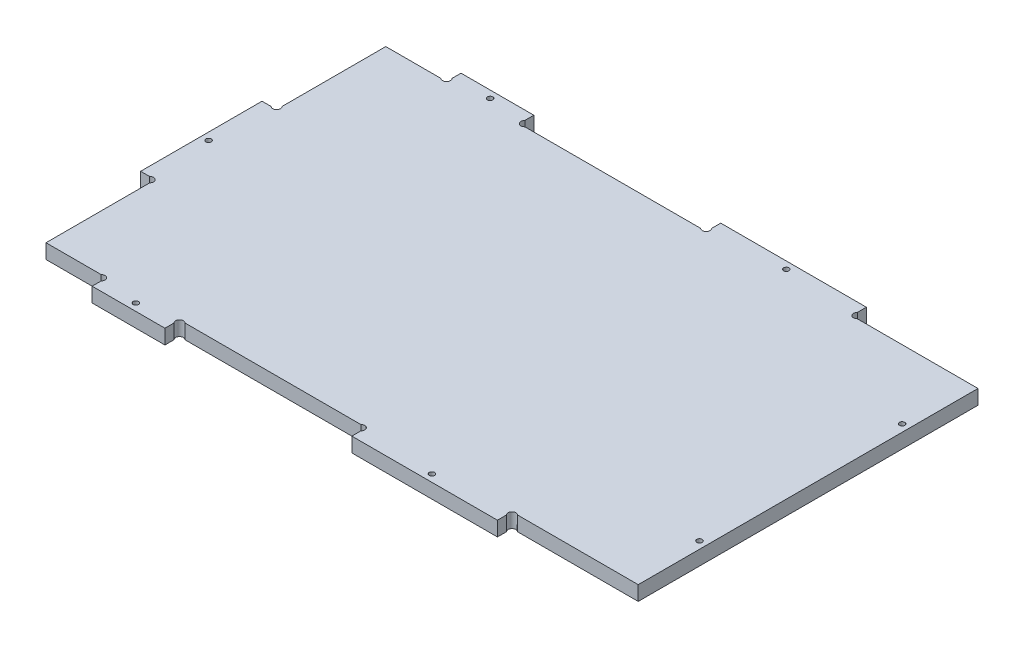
ISO-10303-21;
HEADER;
FILE_DESCRIPTION(('STEP AP214'),'2;1');
FILE_NAME('part.step','',(''),(''),'','','');
FILE_SCHEMA(('AUTOMOTIVE_DESIGN { 1 0 10303 214 1 1 1 1 }'));
ENDSEC;
DATA;
#1=APPLICATION_CONTEXT('core data for automotive mechanical design processes');
#2=APPLICATION_PROTOCOL_DEFINITION('international standard','automotive_design',2000,#1);
#3=PRODUCT_CONTEXT('',#1,'mechanical');
#4=PRODUCT('Part','Part','',(#3));
#5=PRODUCT_RELATED_PRODUCT_CATEGORY('part','',(#4));
#6=PRODUCT_DEFINITION_FORMATION('','',#4);
#7=PRODUCT_DEFINITION_CONTEXT('part definition',#1,'design');
#8=PRODUCT_DEFINITION('design','',#6,#7);
#9=PRODUCT_DEFINITION_SHAPE('','',#8);
#10=(LENGTH_UNIT() NAMED_UNIT(*) SI_UNIT(.MILLI.,.METRE.));
#11=(NAMED_UNIT(*) PLANE_ANGLE_UNIT() SI_UNIT($,.RADIAN.));
#12=(NAMED_UNIT(*) SI_UNIT($,.STERADIAN.) SOLID_ANGLE_UNIT());
#13=UNCERTAINTY_MEASURE_WITH_UNIT(LENGTH_MEASURE(1.E-05),#10,'distance_accuracy_value','');
#14=(GEOMETRIC_REPRESENTATION_CONTEXT(3) GLOBAL_UNCERTAINTY_ASSIGNED_CONTEXT((#13)) GLOBAL_UNIT_ASSIGNED_CONTEXT((#10,
#11,#12)) REPRESENTATION_CONTEXT('',''));
#15=CARTESIAN_POINT('',(0.,0.,0.));
#16=DIRECTION('',(0.,0.,1.));
#17=DIRECTION('',(1.,0.,0.));
#18=AXIS2_PLACEMENT_3D('',#15,#16,#17);
#19=CARTESIAN_POINT('',(29.8686291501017,6.,-147.131370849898));
#20=DIRECTION('',(0.,1.,0.));
#21=DIRECTION('',(0.,0.,1.));
#22=AXIS2_PLACEMENT_3D('',#19,#20,#21);
#23=PLANE('',#22);
#24=CARTESIAN_POINT('',(46.,6.,-3.00000000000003));
#25=DIRECTION('',(0.,1.,0.));
#26=DIRECTION('',(0.,0.,-1.));
#27=AXIS2_PLACEMENT_3D('',#24,#25,#26);
#28=CIRCLE('',#27,1.1);
#29=CARTESIAN_POINT('',(46.,6.,-4.10000000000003));
#30=VERTEX_POINT('',#29);
#31=EDGE_CURVE('E589',#30,#30,#28,.T.);
#32=ORIENTED_EDGE('',*,*,#31,.F.);
#33=EDGE_LOOP('',(#32));
#34=FACE_BOUND('',#33,.T.);
#35=CARTESIAN_POINT('',(168.,6.,-149.));
#36=DIRECTION('',(0.,1.,0.));
#37=DIRECTION('',(0.,0.,1.));
#38=AXIS2_PLACEMENT_3D('',#35,#36,#37);
#39=CIRCLE('',#38,1.09999999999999);
#40=CARTESIAN_POINT('',(168.,6.,-147.9));
#41=VERTEX_POINT('',#40);
#42=EDGE_CURVE('E601',#41,#41,#39,.T.);
#43=ORIENTED_EDGE('',*,*,#42,.F.);
#44=EDGE_LOOP('',(#43));
#45=FACE_BOUND('',#44,.T.);
#46=CARTESIAN_POINT('',(46.,6.,-149.));
#47=DIRECTION('',(0.,1.,0.));
#48=DIRECTION('',(0.,0.,1.));
#49=AXIS2_PLACEMENT_3D('',#46,#47,#48);
#50=CIRCLE('',#49,1.1);
#51=CARTESIAN_POINT('',(46.,6.,-147.9));
#52=VERTEX_POINT('',#51);
#53=EDGE_CURVE('E613',#52,#52,#50,.T.);
#54=ORIENTED_EDGE('',*,*,#53,.F.);
#55=EDGE_LOOP('',(#54));
#56=FACE_BOUND('',#55,.T.);
#57=CARTESIAN_POINT('',(29.8686291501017,6.,-147.131370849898));
#58=DIRECTION('',(0.,-1.,0.));
#59=DIRECTION('',(0.,0.,1.));
#60=AXIS2_PLACEMENT_3D('',#57,#58,#59);
#61=CIRCLE('',#60,1.59999999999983);
#62=CARTESIAN_POINT('',(31.,6.,-148.262741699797));
#63=VERTEX_POINT('',#62);
#64=CARTESIAN_POINT('',(28.7372583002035,6.,-146.));
#65=VERTEX_POINT('',#64);
#66=EDGE_CURVE('E353',#63,#65,#61,.T.);
#67=ORIENTED_EDGE('',*,*,#66,.T.);
#68=DIRECTION('',(-1.,0.,0.));
#69=VECTOR('',#68,1.);
#70=CARTESIAN_POINT('',(6.,6.,-146.));
#71=LINE('',#70,#69);
#72=CARTESIAN_POINT('',(6.,6.,-146.));
#73=VERTEX_POINT('',#72);
#74=EDGE_CURVE('E171',#65,#73,#71,.T.);
#75=ORIENTED_EDGE('',*,*,#74,.T.);
#76=DIRECTION('',(0.,0.,1.));
#77=VECTOR('',#76,1.);
#78=CARTESIAN_POINT('',(6.,6.,-103.262741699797));
#79=LINE('',#78,#77);
#80=CARTESIAN_POINT('',(6.,6.,-103.262741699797));
#81=VERTEX_POINT('',#80);
#82=EDGE_CURVE('E446',#73,#81,#79,.T.);
#83=ORIENTED_EDGE('',*,*,#82,.T.);
#84=CARTESIAN_POINT('',(4.86862915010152,6.,-102.131370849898));
#85=DIRECTION('',(0.,-1.,0.));
#86=DIRECTION('',(0.,0.,1.));
#87=AXIS2_PLACEMENT_3D('',#84,#85,#86);
#88=CIRCLE('',#87,1.6);
#89=CARTESIAN_POINT('',(3.73725830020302,6.,-101.));
#90=VERTEX_POINT('',#89);
#91=EDGE_CURVE('E465',#81,#90,#88,.T.);
#92=ORIENTED_EDGE('',*,*,#91,.T.);
#93=DIRECTION('',(-1.,0.,0.));
#94=VECTOR('',#93,1.);
#95=CARTESIAN_POINT('',(3.73725830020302,6.,-101.));
#96=LINE('',#95,#94);
#97=CARTESIAN_POINT('',(0.,6.,-101.));
#98=VERTEX_POINT('',#97);
#99=EDGE_CURVE('E462',#90,#98,#96,.T.);
#100=ORIENTED_EDGE('',*,*,#99,.T.);
#101=DIRECTION('',(0.,0.,1.));
#102=VECTOR('',#101,1.);
#103=CARTESIAN_POINT('',(0.,6.,-101.));
#104=LINE('',#103,#102);
#105=CARTESIAN_POINT('',(0.,6.,-51.));
#106=VERTEX_POINT('',#105);
#107=EDGE_CURVE('E464',#98,#106,#104,.T.);
#108=ORIENTED_EDGE('',*,*,#107,.T.);
#109=DIRECTION('',(1.,0.,0.));
#110=VECTOR('',#109,1.);
#111=CARTESIAN_POINT('',(3.73725830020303,6.,-51.));
#112=LINE('',#111,#110);
#113=CARTESIAN_POINT('',(3.73725830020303,6.,-51.));
#114=VERTEX_POINT('',#113);
#115=EDGE_CURVE('E467',#106,#114,#112,.T.);
#116=ORIENTED_EDGE('',*,*,#115,.T.);
#117=CARTESIAN_POINT('',(4.86862915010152,6.,-49.8686291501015));
#118=DIRECTION('',(0.,-1.,0.));
#119=DIRECTION('',(0.,0.,-1.));
#120=AXIS2_PLACEMENT_3D('',#117,#118,#119);
#121=CIRCLE('',#120,1.6);
#122=CARTESIAN_POINT('',(6.,6.,-48.7372583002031));
#123=VERTEX_POINT('',#122);
#124=EDGE_CURVE('E473',#114,#123,#121,.T.);
#125=ORIENTED_EDGE('',*,*,#124,.T.);
#126=DIRECTION('',(0.,0.,1.));
#127=VECTOR('',#126,1.);
#128=CARTESIAN_POINT('',(6.,6.,-48.7372583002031));
#129=LINE('',#128,#127);
#130=CARTESIAN_POINT('',(6.,6.,-6.00000000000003));
#131=VERTEX_POINT('',#130);
#132=EDGE_CURVE('E475',#123,#131,#129,.T.);
#133=ORIENTED_EDGE('',*,*,#132,.T.);
#134=DIRECTION('',(1.,0.,0.));
#135=VECTOR('',#134,1.);
#136=CARTESIAN_POINT('',(6.,6.,-6.00000000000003));
#137=LINE('',#136,#135);
#138=CARTESIAN_POINT('',(28.7372583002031,6.,-6.00000000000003));
#139=VERTEX_POINT('',#138);
#140=EDGE_CURVE('E477',#131,#139,#137,.T.);
#141=ORIENTED_EDGE('',*,*,#140,.T.);
#142=CARTESIAN_POINT('',(29.8686291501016,6.,-4.86862915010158));
#143=DIRECTION('',(0.,-1.,0.));
#144=DIRECTION('',(0.,0.,-1.));
#145=AXIS2_PLACEMENT_3D('',#142,#143,#144);
#146=CIRCLE('',#145,1.59999999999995);
#147=CARTESIAN_POINT('',(31.,6.,-3.73725830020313));
#148=VERTEX_POINT('',#147);
#149=EDGE_CURVE('E479',#139,#148,#146,.T.);
#150=ORIENTED_EDGE('',*,*,#149,.T.);
#151=DIRECTION('',(0.,0.,1.));
#152=VECTOR('',#151,1.);
#153=CARTESIAN_POINT('',(31.,6.,-3.73725830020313));
#154=LINE('',#153,#152);
#155=CARTESIAN_POINT('',(31.,6.,0.));
#156=VERTEX_POINT('',#155);
#157=EDGE_CURVE('E481',#148,#156,#154,.T.);
#158=ORIENTED_EDGE('',*,*,#157,.T.);
#159=DIRECTION('',(1.,0.,0.));
#160=VECTOR('',#159,1.);
#161=CARTESIAN_POINT('',(31.,6.,0.));
#162=LINE('',#161,#160);
#163=CARTESIAN_POINT('',(61.,6.,0.));
#164=VERTEX_POINT('',#163);
#165=EDGE_CURVE('E483',#156,#164,#162,.T.);
#166=ORIENTED_EDGE('',*,*,#165,.T.);
#167=DIRECTION('',(0.,0.,-1.));
#168=VECTOR('',#167,1.);
#169=CARTESIAN_POINT('',(61.,6.,0.));
#170=LINE('',#169,#168);
#171=CARTESIAN_POINT('',(61.,6.,-3.73725830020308));
#172=VERTEX_POINT('',#171);
#173=EDGE_CURVE('E485',#164,#172,#170,.T.);
#174=ORIENTED_EDGE('',*,*,#173,.T.);
#175=CARTESIAN_POINT('',(62.1313708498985,6.,-4.86862915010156));
#176=DIRECTION('',(0.,-1.,0.));
#177=DIRECTION('',(0.,0.,1.));
#178=AXIS2_PLACEMENT_3D('',#175,#176,#177);
#179=CIRCLE('',#178,1.59999999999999);
#180=CARTESIAN_POINT('',(63.262741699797,6.,-6.00000000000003));
#181=VERTEX_POINT('',#180);
#182=EDGE_CURVE('E487',#172,#181,#179,.T.);
#183=ORIENTED_EDGE('',*,*,#182,.T.);
#184=DIRECTION('',(1.,0.,0.));
#185=VECTOR('',#184,1.);
#186=CARTESIAN_POINT('',(63.262741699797,6.,-6.00000000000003));
#187=LINE('',#186,#185);
#188=CARTESIAN_POINT('',(135.737258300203,6.,-6.00000000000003));
#189=VERTEX_POINT('',#188);
#190=EDGE_CURVE('E489',#181,#189,#187,.T.);
#191=ORIENTED_EDGE('',*,*,#190,.T.);
#192=CARTESIAN_POINT('',(136.868629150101,6.,-4.86862915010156));
#193=DIRECTION('',(0.,-1.,0.));
#194=DIRECTION('',(0.,0.,-1.));
#195=AXIS2_PLACEMENT_3D('',#192,#193,#194);
#196=CIRCLE('',#195,1.59999999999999);
#197=CARTESIAN_POINT('',(138.,6.,-3.73725830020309));
#198=VERTEX_POINT('',#197);
#199=EDGE_CURVE('E491',#189,#198,#196,.T.);
#200=ORIENTED_EDGE('',*,*,#199,.T.);
#201=DIRECTION('',(0.,0.,1.));
#202=VECTOR('',#201,1.);
#203=CARTESIAN_POINT('',(138.,6.,-3.73725830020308));
#204=LINE('',#203,#202);
#205=CARTESIAN_POINT('',(138.,6.,0.));
#206=VERTEX_POINT('',#205);
#207=EDGE_CURVE('E493',#198,#206,#204,.T.);
#208=ORIENTED_EDGE('',*,*,#207,.T.);
#209=DIRECTION('',(1.,0.,0.));
#210=VECTOR('',#209,1.);
#211=CARTESIAN_POINT('',(138.,6.,0.));
#212=LINE('',#211,#210);
#213=CARTESIAN_POINT('',(198.,6.,0.));
#214=VERTEX_POINT('',#213);
#215=EDGE_CURVE('E495',#206,#214,#212,.T.);
#216=ORIENTED_EDGE('',*,*,#215,.T.);
#217=DIRECTION('',(0.,0.,-1.));
#218=VECTOR('',#217,1.);
#219=CARTESIAN_POINT('',(198.,6.,0.));
#220=LINE('',#219,#218);
#221=CARTESIAN_POINT('',(198.,6.,-3.73725830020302));
#222=VERTEX_POINT('',#221);
#223=EDGE_CURVE('E497',#214,#222,#220,.T.);
#224=ORIENTED_EDGE('',*,*,#223,.T.);
#225=CARTESIAN_POINT('',(199.131370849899,6.,-4.86862915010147));
#226=DIRECTION('',(0.,-1.,0.));
#227=DIRECTION('',(0.,0.,1.));
#228=AXIS2_PLACEMENT_3D('',#225,#226,#227);
#229=CIRCLE('',#228,1.59999999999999);
#230=CARTESIAN_POINT('',(200.262741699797,6.,-5.99999999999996));
#231=VERTEX_POINT('',#230);
#232=EDGE_CURVE('E499',#222,#231,#229,.T.);
#233=ORIENTED_EDGE('',*,*,#232,.T.);
#234=DIRECTION('',(1.,0.,0.));
#235=VECTOR('',#234,1.);
#236=CARTESIAN_POINT('',(200.262741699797,6.,-5.99999999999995));
#237=LINE('',#236,#235);
#238=CARTESIAN_POINT('',(250.,6.,-5.99999999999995));
#239=VERTEX_POINT('',#238);
#240=EDGE_CURVE('E501',#231,#239,#237,.T.);
#241=ORIENTED_EDGE('',*,*,#240,.T.);
#242=DIRECTION('',(0.,0.,-1.));
#243=VECTOR('',#242,1.);
#244=CARTESIAN_POINT('',(250.,6.,-146.));
#245=LINE('',#244,#243);
#246=CARTESIAN_POINT('',(250.,6.,-146.));
#247=VERTEX_POINT('',#246);
#248=EDGE_CURVE('E503',#239,#247,#245,.T.);
#249=ORIENTED_EDGE('',*,*,#248,.T.);
#250=DIRECTION('',(-1.,0.,0.));
#251=VECTOR('',#250,1.);
#252=CARTESIAN_POINT('',(200.262741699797,6.,-146.));
#253=LINE('',#252,#251);
#254=CARTESIAN_POINT('',(200.262741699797,6.,-146.));
#255=VERTEX_POINT('',#254);
#256=EDGE_CURVE('E505',#247,#255,#253,.T.);
#257=ORIENTED_EDGE('',*,*,#256,.T.);
#258=CARTESIAN_POINT('',(199.131370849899,6.,-147.131370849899));
#259=DIRECTION('',(0.,-1.,0.));
#260=DIRECTION('',(0.,0.,-1.));
#261=AXIS2_PLACEMENT_3D('',#258,#259,#260);
#262=CIRCLE('',#261,1.59999999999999);
#263=CARTESIAN_POINT('',(198.,6.,-148.262741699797));
#264=VERTEX_POINT('',#263);
#265=EDGE_CURVE('E507',#255,#264,#262,.T.);
#266=ORIENTED_EDGE('',*,*,#265,.T.);
#267=DIRECTION('',(0.,0.,-1.));
#268=VECTOR('',#267,1.);
#269=CARTESIAN_POINT('',(198.,6.,-152.));
#270=LINE('',#269,#268);
#271=CARTESIAN_POINT('',(198.,6.,-152.));
#272=VERTEX_POINT('',#271);
#273=EDGE_CURVE('E509',#264,#272,#270,.T.);
#274=ORIENTED_EDGE('',*,*,#273,.T.);
#275=DIRECTION('',(-1.,0.,0.));
#276=VECTOR('',#275,1.);
#277=CARTESIAN_POINT('',(138.,6.,-152.));
#278=LINE('',#277,#276);
#279=CARTESIAN_POINT('',(138.,6.,-152.));
#280=VERTEX_POINT('',#279);
#281=EDGE_CURVE('E511',#272,#280,#278,.T.);
#282=ORIENTED_EDGE('',*,*,#281,.T.);
#283=DIRECTION('',(0.,0.,1.));
#284=VECTOR('',#283,1.);
#285=CARTESIAN_POINT('',(138.,6.,-148.262741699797));
#286=LINE('',#285,#284);
#287=CARTESIAN_POINT('',(138.,6.,-148.262741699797));
#288=VERTEX_POINT('',#287);
#289=EDGE_CURVE('E513',#280,#288,#286,.T.);
#290=ORIENTED_EDGE('',*,*,#289,.T.);
#291=CARTESIAN_POINT('',(136.868629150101,6.,-147.131370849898));
#292=DIRECTION('',(0.,-1.,0.));
#293=DIRECTION('',(0.,0.,1.));
#294=AXIS2_PLACEMENT_3D('',#291,#292,#293);
#295=CIRCLE('',#294,1.59999999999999);
#296=CARTESIAN_POINT('',(135.737258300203,6.,-146.));
#297=VERTEX_POINT('',#296);
#298=EDGE_CURVE('E515',#288,#297,#295,.T.);
#299=ORIENTED_EDGE('',*,*,#298,.T.);
#300=DIRECTION('',(-1.,0.,0.));
#301=VECTOR('',#300,1.);
#302=CARTESIAN_POINT('',(63.262741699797,6.,-146.));
#303=LINE('',#302,#301);
#304=CARTESIAN_POINT('',(63.262741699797,6.,-146.));
#305=VERTEX_POINT('',#304);
#306=EDGE_CURVE('E517',#297,#305,#303,.T.);
#307=ORIENTED_EDGE('',*,*,#306,.T.);
#308=CARTESIAN_POINT('',(62.1313708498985,6.,-147.131370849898));
#309=DIRECTION('',(0.,-1.,0.));
#310=DIRECTION('',(0.,0.,-1.));
#311=AXIS2_PLACEMENT_3D('',#308,#309,#310);
#312=CIRCLE('',#311,1.59999999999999);
#313=CARTESIAN_POINT('',(61.,6.,-148.262741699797));
#314=VERTEX_POINT('',#313);
#315=EDGE_CURVE('E268',#305,#314,#312,.T.);
#316=ORIENTED_EDGE('',*,*,#315,.T.);
#317=DIRECTION('',(0.,0.,-1.));
#318=VECTOR('',#317,1.);
#319=CARTESIAN_POINT('',(61.,6.,-152.));
#320=LINE('',#319,#318);
#321=CARTESIAN_POINT('',(61.,6.,-152.));
#322=VERTEX_POINT('',#321);
#323=EDGE_CURVE('E262',#314,#322,#320,.T.);
#324=ORIENTED_EDGE('',*,*,#323,.T.);
#325=DIRECTION('',(-1.,0.,0.));
#326=VECTOR('',#325,1.);
#327=CARTESIAN_POINT('',(31.,6.,-152.));
#328=LINE('',#327,#326);
#329=CARTESIAN_POINT('',(31.,6.,-152.));
#330=VERTEX_POINT('',#329);
#331=EDGE_CURVE('E266',#322,#330,#328,.T.);
#332=ORIENTED_EDGE('',*,*,#331,.T.);
#333=DIRECTION('',(0.,0.,1.));
#334=VECTOR('',#333,1.);
#335=CARTESIAN_POINT('',(31.,6.,-148.262741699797));
#336=LINE('',#335,#334);
#337=EDGE_CURVE('E50',#330,#63,#336,.T.);
#338=ORIENTED_EDGE('',*,*,#337,.T.);
#339=EDGE_LOOP('',(#67,#75,#83,#92,#100,#108,#116,#125,#133,#141,#150,#158,#166,#174,#183,#191,
#200,#208,#216,#224,#233,#241,#249,#257,#266,#274,#282,#290,#299,#307,#316,#324,#332,#338));
#340=FACE_BOUND('',#339,.T.);
#341=CARTESIAN_POINT('',(247.,6.,-34.25));
#342=DIRECTION('',(0.,1.,0.));
#343=DIRECTION('',(0.,0.,1.));
#344=AXIS2_PLACEMENT_3D('',#341,#342,#343);
#345=CIRCLE('',#344,1.09999999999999);
#346=CARTESIAN_POINT('',(247.,6.,-33.15));
#347=VERTEX_POINT('',#346);
#348=EDGE_CURVE('E290',#347,#347,#345,.T.);
#349=ORIENTED_EDGE('',*,*,#348,.F.);
#350=EDGE_LOOP('',(#349));
#351=FACE_BOUND('',#350,.T.);
#352=CARTESIAN_POINT('',(3.,6.,-76.));
#353=DIRECTION('',(0.,1.,0.));
#354=DIRECTION('',(0.,0.,1.));
#355=AXIS2_PLACEMENT_3D('',#352,#353,#354);
#356=CIRCLE('',#355,1.1);
#357=CARTESIAN_POINT('',(3.,6.,-74.9));
#358=VERTEX_POINT('',#357);
#359=EDGE_CURVE('E607',#358,#358,#356,.T.);
#360=ORIENTED_EDGE('',*,*,#359,.F.);
#361=EDGE_LOOP('',(#360));
#362=FACE_BOUND('',#361,.T.);
#363=CARTESIAN_POINT('',(168.,6.,-3.00000000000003));
#364=DIRECTION('',(0.,1.,0.));
#365=DIRECTION('',(0.,0.,-1.));
#366=AXIS2_PLACEMENT_3D('',#363,#364,#365);
#367=CIRCLE('',#366,1.09999999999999);
#368=CARTESIAN_POINT('',(168.,6.,-4.10000000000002));
#369=VERTEX_POINT('',#368);
#370=EDGE_CURVE('E595',#369,#369,#367,.T.);
#371=ORIENTED_EDGE('',*,*,#370,.F.);
#372=EDGE_LOOP('',(#371));
#373=FACE_BOUND('',#372,.T.);
#374=CARTESIAN_POINT('',(247.,6.,-117.75));
#375=DIRECTION('',(0.,1.,0.));
#376=DIRECTION('',(0.,0.,-1.));
#377=AXIS2_PLACEMENT_3D('',#374,#375,#376);
#378=CIRCLE('',#377,1.09999999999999);
#379=CARTESIAN_POINT('',(247.,6.,-118.85));
#380=VERTEX_POINT('',#379);
#381=EDGE_CURVE('E580',#380,#380,#378,.T.);
#382=ORIENTED_EDGE('',*,*,#381,.F.);
#383=EDGE_LOOP('',(#382));
#384=FACE_BOUND('',#383,.T.);
#385=ADVANCED_FACE('F33',(#34,#45,#56,#340,#351,#362,#373,#384),#23,.T.);
#386=CARTESIAN_POINT('',(29.8686291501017,0.,-147.131370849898));
#387=DIRECTION('',(0.,1.,0.));
#388=DIRECTION('',(0.,0.,1.));
#389=AXIS2_PLACEMENT_3D('',#386,#387,#388);
#390=PLANE('',#389);
#391=CARTESIAN_POINT('',(29.8686291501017,0.,-147.131370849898));
#392=DIRECTION('',(0.,-1.,0.));
#393=DIRECTION('',(0.,0.,1.));
#394=AXIS2_PLACEMENT_3D('',#391,#392,#393);
#395=CIRCLE('',#394,1.59999999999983);
#396=CARTESIAN_POINT('',(31.,0.,-148.262741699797));
#397=VERTEX_POINT('',#396);
#398=CARTESIAN_POINT('',(28.7372583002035,0.,-146.));
#399=VERTEX_POINT('',#398);
#400=EDGE_CURVE('E286',#397,#399,#395,.T.);
#401=ORIENTED_EDGE('',*,*,#400,.F.);
#402=DIRECTION('',(0.,0.,1.));
#403=VECTOR('',#402,1.);
#404=CARTESIAN_POINT('',(31.,0.,-148.262741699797));
#405=LINE('',#404,#403);
#406=CARTESIAN_POINT('',(31.,0.,-152.));
#407=VERTEX_POINT('',#406);
#408=EDGE_CURVE('E163',#407,#397,#405,.T.);
#409=ORIENTED_EDGE('',*,*,#408,.F.);
#410=DIRECTION('',(-1.,0.,0.));
#411=VECTOR('',#410,1.);
#412=CARTESIAN_POINT('',(31.,0.,-152.));
#413=LINE('',#412,#411);
#414=CARTESIAN_POINT('',(61.,0.,-152.));
#415=VERTEX_POINT('',#414);
#416=EDGE_CURVE('E157',#415,#407,#413,.T.);
#417=ORIENTED_EDGE('',*,*,#416,.F.);
#418=DIRECTION('',(0.,0.,-1.));
#419=VECTOR('',#418,1.);
#420=CARTESIAN_POINT('',(61.,0.,-152.));
#421=LINE('',#420,#419);
#422=CARTESIAN_POINT('',(61.,0.,-148.262741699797));
#423=VERTEX_POINT('',#422);
#424=EDGE_CURVE('E276',#423,#415,#421,.T.);
#425=ORIENTED_EDGE('',*,*,#424,.F.);
#426=CARTESIAN_POINT('',(62.1313708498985,0.,-147.131370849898));
#427=DIRECTION('',(0.,-1.,0.));
#428=DIRECTION('',(0.,0.,-1.));
#429=AXIS2_PLACEMENT_3D('',#426,#427,#428);
#430=CIRCLE('',#429,1.59999999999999);
#431=CARTESIAN_POINT('',(63.262741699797,0.,-146.));
#432=VERTEX_POINT('',#431);
#433=EDGE_CURVE('E348',#432,#423,#430,.T.);
#434=ORIENTED_EDGE('',*,*,#433,.F.);
#435=DIRECTION('',(-1.,0.,0.));
#436=VECTOR('',#435,1.);
#437=CARTESIAN_POINT('',(63.262741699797,0.,-146.));
#438=LINE('',#437,#436);
#439=CARTESIAN_POINT('',(135.737258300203,0.,-146.));
#440=VERTEX_POINT('',#439);
#441=EDGE_CURVE('E346',#440,#432,#438,.T.);
#442=ORIENTED_EDGE('',*,*,#441,.F.);
#443=CARTESIAN_POINT('',(136.868629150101,0.,-147.131370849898));
#444=DIRECTION('',(0.,-1.,0.));
#445=DIRECTION('',(0.,0.,1.));
#446=AXIS2_PLACEMENT_3D('',#443,#444,#445);
#447=CIRCLE('',#446,1.59999999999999);
#448=CARTESIAN_POINT('',(138.,0.,-148.262741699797));
#449=VERTEX_POINT('',#448);
#450=EDGE_CURVE('E344',#449,#440,#447,.T.);
#451=ORIENTED_EDGE('',*,*,#450,.F.);
#452=DIRECTION('',(0.,0.,1.));
#453=VECTOR('',#452,1.);
#454=CARTESIAN_POINT('',(138.,0.,-148.262741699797));
#455=LINE('',#454,#453);
#456=CARTESIAN_POINT('',(138.,0.,-152.));
#457=VERTEX_POINT('',#456);
#458=EDGE_CURVE('E342',#457,#449,#455,.T.);
#459=ORIENTED_EDGE('',*,*,#458,.F.);
#460=DIRECTION('',(-1.,0.,0.));
#461=VECTOR('',#460,1.);
#462=CARTESIAN_POINT('',(138.,0.,-152.));
#463=LINE('',#462,#461);
#464=CARTESIAN_POINT('',(198.,0.,-152.));
#465=VERTEX_POINT('',#464);
#466=EDGE_CURVE('E340',#465,#457,#463,.T.);
#467=ORIENTED_EDGE('',*,*,#466,.F.);
#468=DIRECTION('',(0.,0.,-1.));
#469=VECTOR('',#468,1.);
#470=CARTESIAN_POINT('',(198.,0.,-152.));
#471=LINE('',#470,#469);
#472=CARTESIAN_POINT('',(198.,0.,-148.262741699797));
#473=VERTEX_POINT('',#472);
#474=EDGE_CURVE('E338',#473,#465,#471,.T.);
#475=ORIENTED_EDGE('',*,*,#474,.F.);
#476=CARTESIAN_POINT('',(199.131370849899,0.,-147.131370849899));
#477=DIRECTION('',(0.,-1.,0.));
#478=DIRECTION('',(0.,0.,-1.));
#479=AXIS2_PLACEMENT_3D('',#476,#477,#478);
#480=CIRCLE('',#479,1.59999999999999);
#481=CARTESIAN_POINT('',(200.262741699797,0.,-146.));
#482=VERTEX_POINT('',#481);
#483=EDGE_CURVE('E336',#482,#473,#480,.T.);
#484=ORIENTED_EDGE('',*,*,#483,.F.);
#485=DIRECTION('',(-1.,0.,0.));
#486=VECTOR('',#485,1.);
#487=CARTESIAN_POINT('',(200.262741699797,0.,-146.));
#488=LINE('',#487,#486);
#489=CARTESIAN_POINT('',(250.,0.,-146.));
#490=VERTEX_POINT('',#489);
#491=EDGE_CURVE('E334',#490,#482,#488,.T.);
#492=ORIENTED_EDGE('',*,*,#491,.F.);
#493=DIRECTION('',(0.,0.,-1.));
#494=VECTOR('',#493,1.);
#495=CARTESIAN_POINT('',(250.,0.,-146.));
#496=LINE('',#495,#494);
#497=CARTESIAN_POINT('',(250.,0.,-5.99999999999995));
#498=VERTEX_POINT('',#497);
#499=EDGE_CURVE('E332',#498,#490,#496,.T.);
#500=ORIENTED_EDGE('',*,*,#499,.F.);
#501=DIRECTION('',(1.,0.,0.));
#502=VECTOR('',#501,1.);
#503=CARTESIAN_POINT('',(200.262741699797,0.,-5.99999999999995));
#504=LINE('',#503,#502);
#505=CARTESIAN_POINT('',(200.262741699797,0.,-5.99999999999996));
#506=VERTEX_POINT('',#505);
#507=EDGE_CURVE('E330',#506,#498,#504,.T.);
#508=ORIENTED_EDGE('',*,*,#507,.F.);
#509=CARTESIAN_POINT('',(199.131370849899,0.,-4.86862915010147));
#510=DIRECTION('',(0.,-1.,0.));
#511=DIRECTION('',(0.,0.,1.));
#512=AXIS2_PLACEMENT_3D('',#509,#510,#511);
#513=CIRCLE('',#512,1.59999999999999);
#514=CARTESIAN_POINT('',(198.,0.,-3.73725830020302));
#515=VERTEX_POINT('',#514);
#516=EDGE_CURVE('E328',#515,#506,#513,.T.);
#517=ORIENTED_EDGE('',*,*,#516,.F.);
#518=DIRECTION('',(0.,0.,-1.));
#519=VECTOR('',#518,1.);
#520=CARTESIAN_POINT('',(198.,0.,0.));
#521=LINE('',#520,#519);
#522=CARTESIAN_POINT('',(198.,0.,0.));
#523=VERTEX_POINT('',#522);
#524=EDGE_CURVE('E326',#523,#515,#521,.T.);
#525=ORIENTED_EDGE('',*,*,#524,.F.);
#526=DIRECTION('',(1.,0.,0.));
#527=VECTOR('',#526,1.);
#528=CARTESIAN_POINT('',(138.,0.,0.));
#529=LINE('',#528,#527);
#530=CARTESIAN_POINT('',(138.,0.,0.));
#531=VERTEX_POINT('',#530);
#532=EDGE_CURVE('E324',#531,#523,#529,.T.);
#533=ORIENTED_EDGE('',*,*,#532,.F.);
#534=DIRECTION('',(0.,0.,1.));
#535=VECTOR('',#534,1.);
#536=CARTESIAN_POINT('',(138.,0.,-3.73725830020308));
#537=LINE('',#536,#535);
#538=CARTESIAN_POINT('',(138.,0.,-3.73725830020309));
#539=VERTEX_POINT('',#538);
#540=EDGE_CURVE('E322',#539,#531,#537,.T.);
#541=ORIENTED_EDGE('',*,*,#540,.F.);
#542=CARTESIAN_POINT('',(136.868629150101,0.,-4.86862915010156));
#543=DIRECTION('',(0.,-1.,0.));
#544=DIRECTION('',(0.,0.,-1.));
#545=AXIS2_PLACEMENT_3D('',#542,#543,#544);
#546=CIRCLE('',#545,1.59999999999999);
#547=CARTESIAN_POINT('',(135.737258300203,0.,-6.00000000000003));
#548=VERTEX_POINT('',#547);
#549=EDGE_CURVE('E320',#548,#539,#546,.T.);
#550=ORIENTED_EDGE('',*,*,#549,.F.);
#551=DIRECTION('',(1.,0.,0.));
#552=VECTOR('',#551,1.);
#553=CARTESIAN_POINT('',(63.262741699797,0.,-6.00000000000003));
#554=LINE('',#553,#552);
#555=CARTESIAN_POINT('',(63.262741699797,0.,-6.00000000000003));
#556=VERTEX_POINT('',#555);
#557=EDGE_CURVE('E318',#556,#548,#554,.T.);
#558=ORIENTED_EDGE('',*,*,#557,.F.);
#559=CARTESIAN_POINT('',(62.1313708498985,0.,-4.86862915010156));
#560=DIRECTION('',(0.,-1.,0.));
#561=DIRECTION('',(0.,0.,1.));
#562=AXIS2_PLACEMENT_3D('',#559,#560,#561);
#563=CIRCLE('',#562,1.59999999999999);
#564=CARTESIAN_POINT('',(61.,0.,-3.73725830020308));
#565=VERTEX_POINT('',#564);
#566=EDGE_CURVE('E316',#565,#556,#563,.T.);
#567=ORIENTED_EDGE('',*,*,#566,.F.);
#568=DIRECTION('',(0.,0.,-1.));
#569=VECTOR('',#568,1.);
#570=CARTESIAN_POINT('',(61.,0.,0.));
#571=LINE('',#570,#569);
#572=CARTESIAN_POINT('',(61.,0.,0.));
#573=VERTEX_POINT('',#572);
#574=EDGE_CURVE('E314',#573,#565,#571,.T.);
#575=ORIENTED_EDGE('',*,*,#574,.F.);
#576=DIRECTION('',(1.,0.,0.));
#577=VECTOR('',#576,1.);
#578=CARTESIAN_POINT('',(31.,0.,0.));
#579=LINE('',#578,#577);
#580=CARTESIAN_POINT('',(31.,0.,0.));
#581=VERTEX_POINT('',#580);
#582=EDGE_CURVE('E312',#581,#573,#579,.T.);
#583=ORIENTED_EDGE('',*,*,#582,.F.);
#584=DIRECTION('',(0.,0.,1.));
#585=VECTOR('',#584,1.);
#586=CARTESIAN_POINT('',(31.,0.,-3.73725830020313));
#587=LINE('',#586,#585);
#588=CARTESIAN_POINT('',(31.,0.,-3.73725830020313));
#589=VERTEX_POINT('',#588);
#590=EDGE_CURVE('E310',#589,#581,#587,.T.);
#591=ORIENTED_EDGE('',*,*,#590,.F.);
#592=CARTESIAN_POINT('',(29.8686291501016,0.,-4.86862915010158));
#593=DIRECTION('',(0.,-1.,0.));
#594=DIRECTION('',(0.,0.,-1.));
#595=AXIS2_PLACEMENT_3D('',#592,#593,#594);
#596=CIRCLE('',#595,1.59999999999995);
#597=CARTESIAN_POINT('',(28.7372583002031,0.,-6.00000000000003));
#598=VERTEX_POINT('',#597);
#599=EDGE_CURVE('E308',#598,#589,#596,.T.);
#600=ORIENTED_EDGE('',*,*,#599,.F.);
#601=DIRECTION('',(1.,0.,0.));
#602=VECTOR('',#601,1.);
#603=CARTESIAN_POINT('',(6.,0.,-6.00000000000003));
#604=LINE('',#603,#602);
#605=CARTESIAN_POINT('',(6.,0.,-6.00000000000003));
#606=VERTEX_POINT('',#605);
#607=EDGE_CURVE('E306',#606,#598,#604,.T.);
#608=ORIENTED_EDGE('',*,*,#607,.F.);
#609=DIRECTION('',(0.,0.,1.));
#610=VECTOR('',#609,1.);
#611=CARTESIAN_POINT('',(6.,0.,-48.7372583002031));
#612=LINE('',#611,#610);
#613=CARTESIAN_POINT('',(6.,0.,-48.7372583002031));
#614=VERTEX_POINT('',#613);
#615=EDGE_CURVE('E304',#614,#606,#612,.T.);
#616=ORIENTED_EDGE('',*,*,#615,.F.);
#617=CARTESIAN_POINT('',(4.86862915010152,0.,-49.8686291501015));
#618=DIRECTION('',(0.,-1.,0.));
#619=DIRECTION('',(0.,0.,-1.));
#620=AXIS2_PLACEMENT_3D('',#617,#618,#619);
#621=CIRCLE('',#620,1.6);
#622=CARTESIAN_POINT('',(3.73725830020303,0.,-51.));
#623=VERTEX_POINT('',#622);
#624=EDGE_CURVE('E302',#623,#614,#621,.T.);
#625=ORIENTED_EDGE('',*,*,#624,.F.);
#626=DIRECTION('',(1.,0.,0.));
#627=VECTOR('',#626,1.);
#628=CARTESIAN_POINT('',(3.73725830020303,0.,-51.));
#629=LINE('',#628,#627);
#630=CARTESIAN_POINT('',(0.,0.,-51.));
#631=VERTEX_POINT('',#630);
#632=EDGE_CURVE('E300',#631,#623,#629,.T.);
#633=ORIENTED_EDGE('',*,*,#632,.F.);
#634=DIRECTION('',(0.,0.,1.));
#635=VECTOR('',#634,1.);
#636=CARTESIAN_POINT('',(0.,0.,-101.));
#637=LINE('',#636,#635);
#638=CARTESIAN_POINT('',(0.,0.,-101.));
#639=VERTEX_POINT('',#638);
#640=EDGE_CURVE('E298',#639,#631,#637,.T.);
#641=ORIENTED_EDGE('',*,*,#640,.F.);
#642=DIRECTION('',(-1.,0.,0.));
#643=VECTOR('',#642,1.);
#644=CARTESIAN_POINT('',(3.73725830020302,0.,-101.));
#645=LINE('',#644,#643);
#646=CARTESIAN_POINT('',(3.73725830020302,0.,-101.));
#647=VERTEX_POINT('',#646);
#648=EDGE_CURVE('E296',#647,#639,#645,.T.);
#649=ORIENTED_EDGE('',*,*,#648,.F.);
#650=CARTESIAN_POINT('',(4.86862915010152,0.,-102.131370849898));
#651=DIRECTION('',(0.,-1.,0.));
#652=DIRECTION('',(0.,0.,1.));
#653=AXIS2_PLACEMENT_3D('',#650,#651,#652);
#654=CIRCLE('',#653,1.6);
#655=CARTESIAN_POINT('',(6.,0.,-103.262741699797));
#656=VERTEX_POINT('',#655);
#657=EDGE_CURVE('E294',#656,#647,#654,.T.);
#658=ORIENTED_EDGE('',*,*,#657,.F.);
#659=DIRECTION('',(0.,0.,1.));
#660=VECTOR('',#659,1.);
#661=CARTESIAN_POINT('',(6.,0.,-103.262741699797));
#662=LINE('',#661,#660);
#663=CARTESIAN_POINT('',(6.,0.,-146.));
#664=VERTEX_POINT('',#663);
#665=EDGE_CURVE('E292',#664,#656,#662,.T.);
#666=ORIENTED_EDGE('',*,*,#665,.F.);
#667=DIRECTION('',(-1.,0.,0.));
#668=VECTOR('',#667,1.);
#669=CARTESIAN_POINT('',(6.,0.,-146.));
#670=LINE('',#669,#668);
#671=EDGE_CURVE('E289',#399,#664,#670,.T.);
#672=ORIENTED_EDGE('',*,*,#671,.F.);
#673=EDGE_LOOP('',(#401,#409,#417,#425,#434,#442,#451,#459,#467,#475,#484,#492,#500,#508,#517,
#525,#533,#541,#550,#558,#567,#575,#583,#591,#600,#608,#616,#625,#633,#641,#649,#658,#666,#672));
#674=FACE_BOUND('',#673,.T.);
#675=CARTESIAN_POINT('',(247.,0.,-34.25));
#676=DIRECTION('',(0.,1.,0.));
#677=DIRECTION('',(0.,0.,1.));
#678=AXIS2_PLACEMENT_3D('',#675,#676,#677);
#679=CIRCLE('',#678,1.09999999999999);
#680=CARTESIAN_POINT('',(247.,0.,-33.15));
#681=VERTEX_POINT('',#680);
#682=EDGE_CURVE('E616',#681,#681,#679,.T.);
#683=ORIENTED_EDGE('',*,*,#682,.T.);
#684=EDGE_LOOP('',(#683));
#685=FACE_BOUND('',#684,.T.);
#686=CARTESIAN_POINT('',(46.,0.,-149.));
#687=DIRECTION('',(0.,1.,0.));
#688=DIRECTION('',(0.,0.,1.));
#689=AXIS2_PLACEMENT_3D('',#686,#687,#688);
#690=CIRCLE('',#689,1.1);
#691=CARTESIAN_POINT('',(46.,0.,-147.9));
#692=VERTEX_POINT('',#691);
#693=EDGE_CURVE('E610',#692,#692,#690,.T.);
#694=ORIENTED_EDGE('',*,*,#693,.T.);
#695=EDGE_LOOP('',(#694));
#696=FACE_BOUND('',#695,.T.);
#697=CARTESIAN_POINT('',(3.,0.,-76.));
#698=DIRECTION('',(0.,1.,0.));
#699=DIRECTION('',(0.,0.,1.));
#700=AXIS2_PLACEMENT_3D('',#697,#698,#699);
#701=CIRCLE('',#700,1.1);
#702=CARTESIAN_POINT('',(3.,0.,-74.9));
#703=VERTEX_POINT('',#702);
#704=EDGE_CURVE('E604',#703,#703,#701,.T.);
#705=ORIENTED_EDGE('',*,*,#704,.T.);
#706=EDGE_LOOP('',(#705));
#707=FACE_BOUND('',#706,.T.);
#708=CARTESIAN_POINT('',(168.,0.,-149.));
#709=DIRECTION('',(0.,1.,0.));
#710=DIRECTION('',(0.,0.,1.));
#711=AXIS2_PLACEMENT_3D('',#708,#709,#710);
#712=CIRCLE('',#711,1.09999999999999);
#713=CARTESIAN_POINT('',(168.,0.,-147.9));
#714=VERTEX_POINT('',#713);
#715=EDGE_CURVE('E598',#714,#714,#712,.T.);
#716=ORIENTED_EDGE('',*,*,#715,.T.);
#717=EDGE_LOOP('',(#716));
#718=FACE_BOUND('',#717,.T.);
#719=CARTESIAN_POINT('',(168.,0.,-3.00000000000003));
#720=DIRECTION('',(0.,1.,0.));
#721=DIRECTION('',(0.,0.,-1.));
#722=AXIS2_PLACEMENT_3D('',#719,#720,#721);
#723=CIRCLE('',#722,1.09999999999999);
#724=CARTESIAN_POINT('',(168.,0.,-4.10000000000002));
#725=VERTEX_POINT('',#724);
#726=EDGE_CURVE('E592',#725,#725,#723,.T.);
#727=ORIENTED_EDGE('',*,*,#726,.T.);
#728=EDGE_LOOP('',(#727));
#729=FACE_BOUND('',#728,.T.);
#730=CARTESIAN_POINT('',(46.,0.,-3.00000000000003));
#731=DIRECTION('',(0.,1.,0.));
#732=DIRECTION('',(0.,0.,-1.));
#733=AXIS2_PLACEMENT_3D('',#730,#731,#732);
#734=CIRCLE('',#733,1.1);
#735=CARTESIAN_POINT('',(46.,0.,-4.10000000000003));
#736=VERTEX_POINT('',#735);
#737=EDGE_CURVE('E586',#736,#736,#734,.T.);
#738=ORIENTED_EDGE('',*,*,#737,.T.);
#739=EDGE_LOOP('',(#738));
#740=FACE_BOUND('',#739,.T.);
#741=CARTESIAN_POINT('',(247.,0.,-117.75));
#742=DIRECTION('',(0.,1.,0.));
#743=DIRECTION('',(0.,0.,-1.));
#744=AXIS2_PLACEMENT_3D('',#741,#742,#743);
#745=CIRCLE('',#744,1.09999999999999);
#746=CARTESIAN_POINT('',(247.,0.,-118.85));
#747=VERTEX_POINT('',#746);
#748=EDGE_CURVE('E583',#747,#747,#745,.T.);
#749=ORIENTED_EDGE('',*,*,#748,.T.);
#750=EDGE_LOOP('',(#749));
#751=FACE_BOUND('',#750,.T.);
#752=ADVANCED_FACE('F450',(#674,#685,#696,#707,#718,#729,#740,#751),#390,.F.);
#753=CARTESIAN_POINT('',(29.8686291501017,6.,-147.131370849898));
#754=DIRECTION('',(0.,-1.,0.));
#755=DIRECTION('',(0.,0.,-1.));
#756=AXIS2_PLACEMENT_3D('',#753,#754,#755);
#757=CYLINDRICAL_SURFACE('',#756,1.59999999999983);
#758=ORIENTED_EDGE('',*,*,#400,.T.);
#759=DIRECTION('',(0.,-1.,0.));
#760=VECTOR('',#759,1.);
#761=CARTESIAN_POINT('',(28.7372583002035,6.,-146.));
#762=LINE('',#761,#760);
#763=EDGE_CURVE('E11',#65,#399,#762,.T.);
#764=ORIENTED_EDGE('',*,*,#763,.F.);
#765=ORIENTED_EDGE('',*,*,#66,.F.);
#766=DIRECTION('',(0.,-1.,0.));
#767=VECTOR('',#766,1.);
#768=CARTESIAN_POINT('',(31.,6.,-148.262741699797));
#769=LINE('',#768,#767);
#770=EDGE_CURVE('E282',#63,#397,#769,.T.);
#771=ORIENTED_EDGE('',*,*,#770,.T.);
#772=EDGE_LOOP('',(#758,#764,#765,#771));
#773=FACE_BOUND('',#772,.T.);
#774=ADVANCED_FACE('F35',(#773),#757,.F.);
#775=CARTESIAN_POINT('',(6.,6.,-146.));
#776=DIRECTION('',(0.,0.,1.));
#777=DIRECTION('',(1.,0.,0.));
#778=AXIS2_PLACEMENT_3D('',#775,#776,#777);
#779=PLANE('',#778);
#780=ORIENTED_EDGE('',*,*,#671,.T.);
#781=DIRECTION('',(0.,-1.,0.));
#782=VECTOR('',#781,1.);
#783=CARTESIAN_POINT('',(6.,6.,-146.));
#784=LINE('',#783,#782);
#785=EDGE_CURVE('E42',#73,#664,#784,.T.);
#786=ORIENTED_EDGE('',*,*,#785,.F.);
#787=ORIENTED_EDGE('',*,*,#74,.F.);
#788=ORIENTED_EDGE('',*,*,#763,.T.);
#789=EDGE_LOOP('',(#780,#786,#787,#788));
#790=FACE_BOUND('',#789,.T.);
#791=ADVANCED_FACE('F973',(#790),#779,.F.);
#792=CARTESIAN_POINT('',(6.,6.,-103.262741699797));
#793=DIRECTION('',(1.,0.,0.));
#794=DIRECTION('',(0.,0.,-1.));
#795=AXIS2_PLACEMENT_3D('',#792,#793,#794);
#796=PLANE('',#795);
#797=ORIENTED_EDGE('',*,*,#665,.T.);
#798=DIRECTION('',(0.,-1.,0.));
#799=VECTOR('',#798,1.);
#800=CARTESIAN_POINT('',(6.,6.,-103.262741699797));
#801=LINE('',#800,#799);
#802=EDGE_CURVE('E438',#81,#656,#801,.T.);
#803=ORIENTED_EDGE('',*,*,#802,.F.);
#804=ORIENTED_EDGE('',*,*,#82,.F.);
#805=ORIENTED_EDGE('',*,*,#785,.T.);
#806=EDGE_LOOP('',(#797,#803,#804,#805));
#807=FACE_BOUND('',#806,.T.);
#808=ADVANCED_FACE('F444',(#807),#796,.F.);
#809=CARTESIAN_POINT('',(4.86862915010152,6.,-102.131370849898));
#810=DIRECTION('',(0.,-1.,0.));
#811=DIRECTION('',(0.,0.,-1.));
#812=AXIS2_PLACEMENT_3D('',#809,#810,#811);
#813=CYLINDRICAL_SURFACE('',#812,1.6);
#814=ORIENTED_EDGE('',*,*,#657,.T.);
#815=DIRECTION('',(0.,-1.,0.));
#816=VECTOR('',#815,1.);
#817=CARTESIAN_POINT('',(3.73725830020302,6.,-101.));
#818=LINE('',#817,#816);
#819=EDGE_CURVE('E435',#90,#647,#818,.T.);
#820=ORIENTED_EDGE('',*,*,#819,.F.);
#821=ORIENTED_EDGE('',*,*,#91,.F.);
#822=ORIENTED_EDGE('',*,*,#802,.T.);
#823=EDGE_LOOP('',(#814,#820,#821,#822));
#824=FACE_BOUND('',#823,.T.);
#825=ADVANCED_FACE('F456',(#824),#813,.F.);
#826=CARTESIAN_POINT('',(3.73725830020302,6.,-101.));
#827=DIRECTION('',(0.,0.,1.));
#828=DIRECTION('',(1.,0.,0.));
#829=AXIS2_PLACEMENT_3D('',#826,#827,#828);
#830=PLANE('',#829);
#831=ORIENTED_EDGE('',*,*,#648,.T.);
#832=DIRECTION('',(0.,-1.,0.));
#833=VECTOR('',#832,1.);
#834=CARTESIAN_POINT('',(0.,6.,-101.));
#835=LINE('',#834,#833);
#836=EDGE_CURVE('E432',#98,#639,#835,.T.);
#837=ORIENTED_EDGE('',*,*,#836,.F.);
#838=ORIENTED_EDGE('',*,*,#99,.F.);
#839=ORIENTED_EDGE('',*,*,#819,.T.);
#840=EDGE_LOOP('',(#831,#837,#838,#839));
#841=FACE_BOUND('',#840,.T.);
#842=ADVANCED_FACE('F460',(#841),#830,.F.);
#843=CARTESIAN_POINT('',(0.,6.,-101.));
#844=DIRECTION('',(1.,0.,0.));
#845=DIRECTION('',(0.,0.,-1.));
#846=AXIS2_PLACEMENT_3D('',#843,#844,#845);
#847=PLANE('',#846);
#848=ORIENTED_EDGE('',*,*,#640,.T.);
#849=DIRECTION('',(0.,-1.,0.));
#850=VECTOR('',#849,1.);
#851=CARTESIAN_POINT('',(0.,6.,-51.));
#852=LINE('',#851,#850);
#853=EDGE_CURVE('E429',#106,#631,#852,.T.);
#854=ORIENTED_EDGE('',*,*,#853,.F.);
#855=ORIENTED_EDGE('',*,*,#107,.F.);
#856=ORIENTED_EDGE('',*,*,#836,.T.);
#857=EDGE_LOOP('',(#848,#854,#855,#856));
#858=FACE_BOUND('',#857,.T.);
#859=ADVANCED_FACE('F938',(#858),#847,.F.);
#860=CARTESIAN_POINT('',(3.73725830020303,6.,-51.));
#861=DIRECTION('',(0.,0.,-1.));
#862=DIRECTION('',(-1.,0.,0.));
#863=AXIS2_PLACEMENT_3D('',#860,#861,#862);
#864=PLANE('',#863);
#865=ORIENTED_EDGE('',*,*,#632,.T.);
#866=DIRECTION('',(0.,-1.,0.));
#867=VECTOR('',#866,1.);
#868=CARTESIAN_POINT('',(3.73725830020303,6.,-51.));
#869=LINE('',#868,#867);
#870=EDGE_CURVE('E426',#114,#623,#869,.T.);
#871=ORIENTED_EDGE('',*,*,#870,.F.);
#872=ORIENTED_EDGE('',*,*,#115,.F.);
#873=ORIENTED_EDGE('',*,*,#853,.T.);
#874=EDGE_LOOP('',(#865,#871,#872,#873));
#875=FACE_BOUND('',#874,.T.);
#876=ADVANCED_FACE('F928',(#875),#864,.F.);
#877=CARTESIAN_POINT('',(4.86862915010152,6.,-49.8686291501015));
#878=DIRECTION('',(0.,-1.,0.));
#879=DIRECTION('',(0.,0.,-1.));
#880=AXIS2_PLACEMENT_3D('',#877,#878,#879);
#881=CYLINDRICAL_SURFACE('',#880,1.6);
#882=ORIENTED_EDGE('',*,*,#624,.T.);
#883=DIRECTION('',(0.,-1.,0.));
#884=VECTOR('',#883,1.);
#885=CARTESIAN_POINT('',(6.,6.,-48.7372583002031));
#886=LINE('',#885,#884);
#887=EDGE_CURVE('E423',#123,#614,#886,.T.);
#888=ORIENTED_EDGE('',*,*,#887,.F.);
#889=ORIENTED_EDGE('',*,*,#124,.F.);
#890=ORIENTED_EDGE('',*,*,#870,.T.);
#891=EDGE_LOOP('',(#882,#888,#889,#890));
#892=FACE_BOUND('',#891,.T.);
#893=ADVANCED_FACE('F918',(#892),#881,.F.);
#894=CARTESIAN_POINT('',(6.,6.,-48.7372583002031));
#895=DIRECTION('',(1.,0.,0.));
#896=DIRECTION('',(0.,0.,-1.));
#897=AXIS2_PLACEMENT_3D('',#894,#895,#896);
#898=PLANE('',#897);
#899=ORIENTED_EDGE('',*,*,#615,.T.);
#900=DIRECTION('',(0.,-1.,0.));
#901=VECTOR('',#900,1.);
#902=CARTESIAN_POINT('',(6.,6.,-6.00000000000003));
#903=LINE('',#902,#901);
#904=EDGE_CURVE('E420',#131,#606,#903,.T.);
#905=ORIENTED_EDGE('',*,*,#904,.F.);
#906=ORIENTED_EDGE('',*,*,#132,.F.);
#907=ORIENTED_EDGE('',*,*,#887,.T.);
#908=EDGE_LOOP('',(#899,#905,#906,#907));
#909=FACE_BOUND('',#908,.T.);
#910=ADVANCED_FACE('F908',(#909),#898,.F.);
#911=CARTESIAN_POINT('',(6.,6.,-6.00000000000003));
#912=DIRECTION('',(0.,0.,-1.));
#913=DIRECTION('',(-1.,0.,0.));
#914=AXIS2_PLACEMENT_3D('',#911,#912,#913);
#915=PLANE('',#914);
#916=ORIENTED_EDGE('',*,*,#607,.T.);
#917=DIRECTION('',(0.,-1.,0.));
#918=VECTOR('',#917,1.);
#919=CARTESIAN_POINT('',(28.7372583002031,6.,-6.00000000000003));
#920=LINE('',#919,#918);
#921=EDGE_CURVE('E417',#139,#598,#920,.T.);
#922=ORIENTED_EDGE('',*,*,#921,.F.);
#923=ORIENTED_EDGE('',*,*,#140,.F.);
#924=ORIENTED_EDGE('',*,*,#904,.T.);
#925=EDGE_LOOP('',(#916,#922,#923,#924));
#926=FACE_BOUND('',#925,.T.);
#927=ADVANCED_FACE('F898',(#926),#915,.F.);
#928=CARTESIAN_POINT('',(29.8686291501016,6.,-4.86862915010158));
#929=DIRECTION('',(0.,-1.,0.));
#930=DIRECTION('',(0.,0.,-1.));
#931=AXIS2_PLACEMENT_3D('',#928,#929,#930);
#932=CYLINDRICAL_SURFACE('',#931,1.59999999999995);
#933=ORIENTED_EDGE('',*,*,#599,.T.);
#934=DIRECTION('',(0.,-1.,0.));
#935=VECTOR('',#934,1.);
#936=CARTESIAN_POINT('',(31.,6.,-3.73725830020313));
#937=LINE('',#936,#935);
#938=EDGE_CURVE('E414',#148,#589,#937,.T.);
#939=ORIENTED_EDGE('',*,*,#938,.F.);
#940=ORIENTED_EDGE('',*,*,#149,.F.);
#941=ORIENTED_EDGE('',*,*,#921,.T.);
#942=EDGE_LOOP('',(#933,#939,#940,#941));
#943=FACE_BOUND('',#942,.T.);
#944=ADVANCED_FACE('F888',(#943),#932,.F.);
#945=CARTESIAN_POINT('',(31.,6.,-3.73725830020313));
#946=DIRECTION('',(1.,0.,0.));
#947=DIRECTION('',(0.,0.,-1.));
#948=AXIS2_PLACEMENT_3D('',#945,#946,#947);
#949=PLANE('',#948);
#950=ORIENTED_EDGE('',*,*,#590,.T.);
#951=DIRECTION('',(0.,-1.,0.));
#952=VECTOR('',#951,1.);
#953=CARTESIAN_POINT('',(31.,6.,0.));
#954=LINE('',#953,#952);
#955=EDGE_CURVE('E411',#156,#581,#954,.T.);
#956=ORIENTED_EDGE('',*,*,#955,.F.);
#957=ORIENTED_EDGE('',*,*,#157,.F.);
#958=ORIENTED_EDGE('',*,*,#938,.T.);
#959=EDGE_LOOP('',(#950,#956,#957,#958));
#960=FACE_BOUND('',#959,.T.);
#961=ADVANCED_FACE('F878',(#960),#949,.F.);
#962=CARTESIAN_POINT('',(31.,6.,0.));
#963=DIRECTION('',(0.,0.,-1.));
#964=DIRECTION('',(-1.,0.,0.));
#965=AXIS2_PLACEMENT_3D('',#962,#963,#964);
#966=PLANE('',#965);
#967=ORIENTED_EDGE('',*,*,#582,.T.);
#968=DIRECTION('',(0.,-1.,0.));
#969=VECTOR('',#968,1.);
#970=CARTESIAN_POINT('',(61.,6.,0.));
#971=LINE('',#970,#969);
#972=EDGE_CURVE('E408',#164,#573,#971,.T.);
#973=ORIENTED_EDGE('',*,*,#972,.F.);
#974=ORIENTED_EDGE('',*,*,#165,.F.);
#975=ORIENTED_EDGE('',*,*,#955,.T.);
#976=EDGE_LOOP('',(#967,#973,#974,#975));
#977=FACE_BOUND('',#976,.T.);
#978=ADVANCED_FACE('F868',(#977),#966,.F.);
#979=CARTESIAN_POINT('',(61.,6.,0.));
#980=DIRECTION('',(-1.,0.,0.));
#981=DIRECTION('',(0.,0.,1.));
#982=AXIS2_PLACEMENT_3D('',#979,#980,#981);
#983=PLANE('',#982);
#984=ORIENTED_EDGE('',*,*,#574,.T.);
#985=DIRECTION('',(0.,-1.,0.));
#986=VECTOR('',#985,1.);
#987=CARTESIAN_POINT('',(61.,6.,-3.73725830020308));
#988=LINE('',#987,#986);
#989=EDGE_CURVE('E405',#172,#565,#988,.T.);
#990=ORIENTED_EDGE('',*,*,#989,.F.);
#991=ORIENTED_EDGE('',*,*,#173,.F.);
#992=ORIENTED_EDGE('',*,*,#972,.T.);
#993=EDGE_LOOP('',(#984,#990,#991,#992));
#994=FACE_BOUND('',#993,.T.);
#995=ADVANCED_FACE('F858',(#994),#983,.F.);
#996=CARTESIAN_POINT('',(62.1313708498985,6.,-4.86862915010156));
#997=DIRECTION('',(0.,-1.,0.));
#998=DIRECTION('',(0.,0.,-1.));
#999=AXIS2_PLACEMENT_3D('',#996,#997,#998);
#1000=CYLINDRICAL_SURFACE('',#999,1.59999999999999);
#1001=ORIENTED_EDGE('',*,*,#566,.T.);
#1002=DIRECTION('',(0.,-1.,0.));
#1003=VECTOR('',#1002,1.);
#1004=CARTESIAN_POINT('',(63.262741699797,6.,-6.00000000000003));
#1005=LINE('',#1004,#1003);
#1006=EDGE_CURVE('E402',#181,#556,#1005,.T.);
#1007=ORIENTED_EDGE('',*,*,#1006,.F.);
#1008=ORIENTED_EDGE('',*,*,#182,.F.);
#1009=ORIENTED_EDGE('',*,*,#989,.T.);
#1010=EDGE_LOOP('',(#1001,#1007,#1008,#1009));
#1011=FACE_BOUND('',#1010,.T.);
#1012=ADVANCED_FACE('F848',(#1011),#1000,.F.);
#1013=CARTESIAN_POINT('',(63.262741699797,6.,-6.00000000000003));
#1014=DIRECTION('',(0.,0.,-1.));
#1015=DIRECTION('',(-1.,0.,0.));
#1016=AXIS2_PLACEMENT_3D('',#1013,#1014,#1015);
#1017=PLANE('',#1016);
#1018=ORIENTED_EDGE('',*,*,#557,.T.);
#1019=DIRECTION('',(0.,-1.,0.));
#1020=VECTOR('',#1019,1.);
#1021=CARTESIAN_POINT('',(135.737258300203,6.,-6.00000000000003));
#1022=LINE('',#1021,#1020);
#1023=EDGE_CURVE('E399',#189,#548,#1022,.T.);
#1024=ORIENTED_EDGE('',*,*,#1023,.F.);
#1025=ORIENTED_EDGE('',*,*,#190,.F.);
#1026=ORIENTED_EDGE('',*,*,#1006,.T.);
#1027=EDGE_LOOP('',(#1018,#1024,#1025,#1026));
#1028=FACE_BOUND('',#1027,.T.);
#1029=ADVANCED_FACE('F838',(#1028),#1017,.F.);
#1030=CARTESIAN_POINT('',(136.868629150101,6.,-4.86862915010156));
#1031=DIRECTION('',(0.,-1.,0.));
#1032=DIRECTION('',(0.,0.,-1.));
#1033=AXIS2_PLACEMENT_3D('',#1030,#1031,#1032);
#1034=CYLINDRICAL_SURFACE('',#1033,1.59999999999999);
#1035=ORIENTED_EDGE('',*,*,#549,.T.);
#1036=DIRECTION('',(0.,-1.,0.));
#1037=VECTOR('',#1036,1.);
#1038=CARTESIAN_POINT('',(138.,6.,-3.73725830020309));
#1039=LINE('',#1038,#1037);
#1040=EDGE_CURVE('E396',#198,#539,#1039,.T.);
#1041=ORIENTED_EDGE('',*,*,#1040,.F.);
#1042=ORIENTED_EDGE('',*,*,#199,.F.);
#1043=ORIENTED_EDGE('',*,*,#1023,.T.);
#1044=EDGE_LOOP('',(#1035,#1041,#1042,#1043));
#1045=FACE_BOUND('',#1044,.T.);
#1046=ADVANCED_FACE('F828',(#1045),#1034,.F.);
#1047=CARTESIAN_POINT('',(138.,6.,-3.73725830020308));
#1048=DIRECTION('',(1.,0.,0.));
#1049=DIRECTION('',(0.,0.,-1.));
#1050=AXIS2_PLACEMENT_3D('',#1047,#1048,#1049);
#1051=PLANE('',#1050);
#1052=ORIENTED_EDGE('',*,*,#540,.T.);
#1053=DIRECTION('',(0.,-1.,0.));
#1054=VECTOR('',#1053,1.);
#1055=CARTESIAN_POINT('',(138.,6.,0.));
#1056=LINE('',#1055,#1054);
#1057=EDGE_CURVE('E393',#206,#531,#1056,.T.);
#1058=ORIENTED_EDGE('',*,*,#1057,.F.);
#1059=ORIENTED_EDGE('',*,*,#207,.F.);
#1060=ORIENTED_EDGE('',*,*,#1040,.T.);
#1061=EDGE_LOOP('',(#1052,#1058,#1059,#1060));
#1062=FACE_BOUND('',#1061,.T.);
#1063=ADVANCED_FACE('F818',(#1062),#1051,.F.);
#1064=CARTESIAN_POINT('',(138.,6.,0.));
#1065=DIRECTION('',(0.,0.,-1.));
#1066=DIRECTION('',(-1.,0.,0.));
#1067=AXIS2_PLACEMENT_3D('',#1064,#1065,#1066);
#1068=PLANE('',#1067);
#1069=ORIENTED_EDGE('',*,*,#532,.T.);
#1070=DIRECTION('',(0.,-1.,0.));
#1071=VECTOR('',#1070,1.);
#1072=CARTESIAN_POINT('',(198.,6.,0.));
#1073=LINE('',#1072,#1071);
#1074=EDGE_CURVE('E390',#214,#523,#1073,.T.);
#1075=ORIENTED_EDGE('',*,*,#1074,.F.);
#1076=ORIENTED_EDGE('',*,*,#215,.F.);
#1077=ORIENTED_EDGE('',*,*,#1057,.T.);
#1078=EDGE_LOOP('',(#1069,#1075,#1076,#1077));
#1079=FACE_BOUND('',#1078,.T.);
#1080=ADVANCED_FACE('F808',(#1079),#1068,.F.);
#1081=CARTESIAN_POINT('',(198.,6.,0.));
#1082=DIRECTION('',(-1.,0.,0.));
#1083=DIRECTION('',(0.,0.,1.));
#1084=AXIS2_PLACEMENT_3D('',#1081,#1082,#1083);
#1085=PLANE('',#1084);
#1086=ORIENTED_EDGE('',*,*,#524,.T.);
#1087=DIRECTION('',(0.,-1.,0.));
#1088=VECTOR('',#1087,1.);
#1089=CARTESIAN_POINT('',(198.,6.,-3.73725830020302));
#1090=LINE('',#1089,#1088);
#1091=EDGE_CURVE('E387',#222,#515,#1090,.T.);
#1092=ORIENTED_EDGE('',*,*,#1091,.F.);
#1093=ORIENTED_EDGE('',*,*,#223,.F.);
#1094=ORIENTED_EDGE('',*,*,#1074,.T.);
#1095=EDGE_LOOP('',(#1086,#1092,#1093,#1094));
#1096=FACE_BOUND('',#1095,.T.);
#1097=ADVANCED_FACE('F798',(#1096),#1085,.F.);
#1098=CARTESIAN_POINT('',(199.131370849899,6.,-4.86862915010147));
#1099=DIRECTION('',(0.,-1.,0.));
#1100=DIRECTION('',(0.,0.,-1.));
#1101=AXIS2_PLACEMENT_3D('',#1098,#1099,#1100);
#1102=CYLINDRICAL_SURFACE('',#1101,1.59999999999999);
#1103=ORIENTED_EDGE('',*,*,#516,.T.);
#1104=DIRECTION('',(0.,-1.,0.));
#1105=VECTOR('',#1104,1.);
#1106=CARTESIAN_POINT('',(200.262741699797,6.,-5.99999999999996));
#1107=LINE('',#1106,#1105);
#1108=EDGE_CURVE('E384',#231,#506,#1107,.T.);
#1109=ORIENTED_EDGE('',*,*,#1108,.F.);
#1110=ORIENTED_EDGE('',*,*,#232,.F.);
#1111=ORIENTED_EDGE('',*,*,#1091,.T.);
#1112=EDGE_LOOP('',(#1103,#1109,#1110,#1111));
#1113=FACE_BOUND('',#1112,.T.);
#1114=ADVANCED_FACE('F788',(#1113),#1102,.F.);
#1115=CARTESIAN_POINT('',(200.262741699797,6.,-5.99999999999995));
#1116=DIRECTION('',(0.,0.,-1.));
#1117=DIRECTION('',(-1.,0.,0.));
#1118=AXIS2_PLACEMENT_3D('',#1115,#1116,#1117);
#1119=PLANE('',#1118);
#1120=ORIENTED_EDGE('',*,*,#507,.T.);
#1121=DIRECTION('',(0.,-1.,0.));
#1122=VECTOR('',#1121,1.);
#1123=CARTESIAN_POINT('',(250.,6.,-5.99999999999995));
#1124=LINE('',#1123,#1122);
#1125=EDGE_CURVE('E381',#239,#498,#1124,.T.);
#1126=ORIENTED_EDGE('',*,*,#1125,.F.);
#1127=ORIENTED_EDGE('',*,*,#240,.F.);
#1128=ORIENTED_EDGE('',*,*,#1108,.T.);
#1129=EDGE_LOOP('',(#1120,#1126,#1127,#1128));
#1130=FACE_BOUND('',#1129,.T.);
#1131=ADVANCED_FACE('F778',(#1130),#1119,.F.);
#1132=CARTESIAN_POINT('',(250.,6.,-146.));
#1133=DIRECTION('',(-1.,0.,0.));
#1134=DIRECTION('',(0.,0.,1.));
#1135=AXIS2_PLACEMENT_3D('',#1132,#1133,#1134);
#1136=PLANE('',#1135);
#1137=ORIENTED_EDGE('',*,*,#499,.T.);
#1138=DIRECTION('',(0.,-1.,0.));
#1139=VECTOR('',#1138,1.);
#1140=CARTESIAN_POINT('',(250.,6.,-146.));
#1141=LINE('',#1140,#1139);
#1142=EDGE_CURVE('E378',#247,#490,#1141,.T.);
#1143=ORIENTED_EDGE('',*,*,#1142,.F.);
#1144=ORIENTED_EDGE('',*,*,#248,.F.);
#1145=ORIENTED_EDGE('',*,*,#1125,.T.);
#1146=EDGE_LOOP('',(#1137,#1143,#1144,#1145));
#1147=FACE_BOUND('',#1146,.T.);
#1148=ADVANCED_FACE('F768',(#1147),#1136,.F.);
#1149=CARTESIAN_POINT('',(200.262741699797,6.,-146.));
#1150=DIRECTION('',(0.,0.,1.));
#1151=DIRECTION('',(1.,0.,0.));
#1152=AXIS2_PLACEMENT_3D('',#1149,#1150,#1151);
#1153=PLANE('',#1152);
#1154=ORIENTED_EDGE('',*,*,#491,.T.);
#1155=DIRECTION('',(0.,-1.,0.));
#1156=VECTOR('',#1155,1.);
#1157=CARTESIAN_POINT('',(200.262741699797,6.,-146.));
#1158=LINE('',#1157,#1156);
#1159=EDGE_CURVE('E375',#255,#482,#1158,.T.);
#1160=ORIENTED_EDGE('',*,*,#1159,.F.);
#1161=ORIENTED_EDGE('',*,*,#256,.F.);
#1162=ORIENTED_EDGE('',*,*,#1142,.T.);
#1163=EDGE_LOOP('',(#1154,#1160,#1161,#1162));
#1164=FACE_BOUND('',#1163,.T.);
#1165=ADVANCED_FACE('F758',(#1164),#1153,.F.);
#1166=CARTESIAN_POINT('',(199.131370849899,6.,-147.131370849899));
#1167=DIRECTION('',(0.,-1.,0.));
#1168=DIRECTION('',(0.,0.,-1.));
#1169=AXIS2_PLACEMENT_3D('',#1166,#1167,#1168);
#1170=CYLINDRICAL_SURFACE('',#1169,1.59999999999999);
#1171=ORIENTED_EDGE('',*,*,#483,.T.);
#1172=DIRECTION('',(0.,-1.,0.));
#1173=VECTOR('',#1172,1.);
#1174=CARTESIAN_POINT('',(198.,6.,-148.262741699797));
#1175=LINE('',#1174,#1173);
#1176=EDGE_CURVE('E372',#264,#473,#1175,.T.);
#1177=ORIENTED_EDGE('',*,*,#1176,.F.);
#1178=ORIENTED_EDGE('',*,*,#265,.F.);
#1179=ORIENTED_EDGE('',*,*,#1159,.T.);
#1180=EDGE_LOOP('',(#1171,#1177,#1178,#1179));
#1181=FACE_BOUND('',#1180,.T.);
#1182=ADVANCED_FACE('F748',(#1181),#1170,.F.);
#1183=CARTESIAN_POINT('',(198.,6.,-152.));
#1184=DIRECTION('',(-1.,0.,0.));
#1185=DIRECTION('',(0.,0.,1.));
#1186=AXIS2_PLACEMENT_3D('',#1183,#1184,#1185);
#1187=PLANE('',#1186);
#1188=ORIENTED_EDGE('',*,*,#474,.T.);
#1189=DIRECTION('',(0.,-1.,0.));
#1190=VECTOR('',#1189,1.);
#1191=CARTESIAN_POINT('',(198.,6.,-152.));
#1192=LINE('',#1191,#1190);
#1193=EDGE_CURVE('E369',#272,#465,#1192,.T.);
#1194=ORIENTED_EDGE('',*,*,#1193,.F.);
#1195=ORIENTED_EDGE('',*,*,#273,.F.);
#1196=ORIENTED_EDGE('',*,*,#1176,.T.);
#1197=EDGE_LOOP('',(#1188,#1194,#1195,#1196));
#1198=FACE_BOUND('',#1197,.T.);
#1199=ADVANCED_FACE('F738',(#1198),#1187,.F.);
#1200=CARTESIAN_POINT('',(138.,6.,-152.));
#1201=DIRECTION('',(0.,0.,1.));
#1202=DIRECTION('',(1.,0.,0.));
#1203=AXIS2_PLACEMENT_3D('',#1200,#1201,#1202);
#1204=PLANE('',#1203);
#1205=ORIENTED_EDGE('',*,*,#466,.T.);
#1206=DIRECTION('',(0.,-1.,0.));
#1207=VECTOR('',#1206,1.);
#1208=CARTESIAN_POINT('',(138.,6.,-152.));
#1209=LINE('',#1208,#1207);
#1210=EDGE_CURVE('E366',#280,#457,#1209,.T.);
#1211=ORIENTED_EDGE('',*,*,#1210,.F.);
#1212=ORIENTED_EDGE('',*,*,#281,.F.);
#1213=ORIENTED_EDGE('',*,*,#1193,.T.);
#1214=EDGE_LOOP('',(#1205,#1211,#1212,#1213));
#1215=FACE_BOUND('',#1214,.T.);
#1216=ADVANCED_FACE('F728',(#1215),#1204,.F.);
#1217=CARTESIAN_POINT('',(138.,6.,-148.262741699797));
#1218=DIRECTION('',(1.,0.,0.));
#1219=DIRECTION('',(0.,0.,-1.));
#1220=AXIS2_PLACEMENT_3D('',#1217,#1218,#1219);
#1221=PLANE('',#1220);
#1222=ORIENTED_EDGE('',*,*,#458,.T.);
#1223=DIRECTION('',(0.,-1.,0.));
#1224=VECTOR('',#1223,1.);
#1225=CARTESIAN_POINT('',(138.,6.,-148.262741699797));
#1226=LINE('',#1225,#1224);
#1227=EDGE_CURVE('E363',#288,#449,#1226,.T.);
#1228=ORIENTED_EDGE('',*,*,#1227,.F.);
#1229=ORIENTED_EDGE('',*,*,#289,.F.);
#1230=ORIENTED_EDGE('',*,*,#1210,.T.);
#1231=EDGE_LOOP('',(#1222,#1228,#1229,#1230));
#1232=FACE_BOUND('',#1231,.T.);
#1233=ADVANCED_FACE('F718',(#1232),#1221,.F.);
#1234=CARTESIAN_POINT('',(136.868629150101,6.,-147.131370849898));
#1235=DIRECTION('',(0.,-1.,0.));
#1236=DIRECTION('',(0.,0.,-1.));
#1237=AXIS2_PLACEMENT_3D('',#1234,#1235,#1236);
#1238=CYLINDRICAL_SURFACE('',#1237,1.59999999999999);
#1239=ORIENTED_EDGE('',*,*,#450,.T.);
#1240=DIRECTION('',(0.,-1.,0.));
#1241=VECTOR('',#1240,1.);
#1242=CARTESIAN_POINT('',(135.737258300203,6.,-146.));
#1243=LINE('',#1242,#1241);
#1244=EDGE_CURVE('E360',#297,#440,#1243,.T.);
#1245=ORIENTED_EDGE('',*,*,#1244,.F.);
#1246=ORIENTED_EDGE('',*,*,#298,.F.);
#1247=ORIENTED_EDGE('',*,*,#1227,.T.);
#1248=EDGE_LOOP('',(#1239,#1245,#1246,#1247));
#1249=FACE_BOUND('',#1248,.T.);
#1250=ADVANCED_FACE('F709',(#1249),#1238,.F.);
#1251=CARTESIAN_POINT('',(63.262741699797,6.,-146.));
#1252=DIRECTION('',(0.,0.,1.));
#1253=DIRECTION('',(1.,0.,0.));
#1254=AXIS2_PLACEMENT_3D('',#1251,#1252,#1253);
#1255=PLANE('',#1254);
#1256=ORIENTED_EDGE('',*,*,#441,.T.);
#1257=DIRECTION('',(0.,-1.,0.));
#1258=VECTOR('',#1257,1.);
#1259=CARTESIAN_POINT('',(63.262741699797,6.,-146.));
#1260=LINE('',#1259,#1258);
#1261=EDGE_CURVE('E357',#305,#432,#1260,.T.);
#1262=ORIENTED_EDGE('',*,*,#1261,.F.);
#1263=ORIENTED_EDGE('',*,*,#306,.F.);
#1264=ORIENTED_EDGE('',*,*,#1244,.T.);
#1265=EDGE_LOOP('',(#1256,#1262,#1263,#1264));
#1266=FACE_BOUND('',#1265,.T.);
#1267=ADVANCED_FACE('F523',(#1266),#1255,.F.);
#1268=CARTESIAN_POINT('',(62.1313708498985,6.,-147.131370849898));
#1269=DIRECTION('',(0.,-1.,0.));
#1270=DIRECTION('',(0.,0.,-1.));
#1271=AXIS2_PLACEMENT_3D('',#1268,#1269,#1270);
#1272=CYLINDRICAL_SURFACE('',#1271,1.59999999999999);
#1273=ORIENTED_EDGE('',*,*,#433,.T.);
#1274=DIRECTION('',(0.,-1.,0.));
#1275=VECTOR('',#1274,1.);
#1276=CARTESIAN_POINT('',(61.,6.,-148.262741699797));
#1277=LINE('',#1276,#1275);
#1278=EDGE_CURVE('E277',#314,#423,#1277,.T.);
#1279=ORIENTED_EDGE('',*,*,#1278,.F.);
#1280=ORIENTED_EDGE('',*,*,#315,.F.);
#1281=ORIENTED_EDGE('',*,*,#1261,.T.);
#1282=EDGE_LOOP('',(#1273,#1279,#1280,#1281));
#1283=FACE_BOUND('',#1282,.T.);
#1284=ADVANCED_FACE('F527',(#1283),#1272,.F.);
#1285=CARTESIAN_POINT('',(61.,6.,-152.));
#1286=DIRECTION('',(-1.,0.,0.));
#1287=DIRECTION('',(0.,0.,1.));
#1288=AXIS2_PLACEMENT_3D('',#1285,#1286,#1287);
#1289=PLANE('',#1288);
#1290=ORIENTED_EDGE('',*,*,#424,.T.);
#1291=DIRECTION('',(0.,-1.,0.));
#1292=VECTOR('',#1291,1.);
#1293=CARTESIAN_POINT('',(61.,6.,-152.));
#1294=LINE('',#1293,#1292);
#1295=EDGE_CURVE('E273',#322,#415,#1294,.T.);
#1296=ORIENTED_EDGE('',*,*,#1295,.F.);
#1297=ORIENTED_EDGE('',*,*,#323,.F.);
#1298=ORIENTED_EDGE('',*,*,#1278,.T.);
#1299=EDGE_LOOP('',(#1290,#1296,#1297,#1298));
#1300=FACE_BOUND('',#1299,.T.);
#1301=ADVANCED_FACE('F274',(#1300),#1289,.F.);
#1302=CARTESIAN_POINT('',(31.,6.,-152.));
#1303=DIRECTION('',(0.,0.,1.));
#1304=DIRECTION('',(1.,0.,0.));
#1305=AXIS2_PLACEMENT_3D('',#1302,#1303,#1304);
#1306=PLANE('',#1305);
#1307=ORIENTED_EDGE('',*,*,#416,.T.);
#1308=DIRECTION('',(0.,-1.,0.));
#1309=VECTOR('',#1308,1.);
#1310=CARTESIAN_POINT('',(31.,6.,-152.));
#1311=LINE('',#1310,#1309);
#1312=EDGE_CURVE('E278',#330,#407,#1311,.T.);
#1313=ORIENTED_EDGE('',*,*,#1312,.F.);
#1314=ORIENTED_EDGE('',*,*,#331,.F.);
#1315=ORIENTED_EDGE('',*,*,#1295,.T.);
#1316=EDGE_LOOP('',(#1307,#1313,#1314,#1315));
#1317=FACE_BOUND('',#1316,.T.);
#1318=ADVANCED_FACE('F280',(#1317),#1306,.F.);
#1319=CARTESIAN_POINT('',(31.,6.,-148.262741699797));
#1320=DIRECTION('',(1.,0.,0.));
#1321=DIRECTION('',(0.,0.,-1.));
#1322=AXIS2_PLACEMENT_3D('',#1319,#1320,#1321);
#1323=PLANE('',#1322);
#1324=ORIENTED_EDGE('',*,*,#408,.T.);
#1325=ORIENTED_EDGE('',*,*,#770,.F.);
#1326=ORIENTED_EDGE('',*,*,#337,.F.);
#1327=ORIENTED_EDGE('',*,*,#1312,.T.);
#1328=EDGE_LOOP('',(#1324,#1325,#1326,#1327));
#1329=FACE_BOUND('',#1328,.T.);
#1330=ADVANCED_FACE('F531',(#1329),#1323,.F.);
#1331=CARTESIAN_POINT('',(247.,6.,-34.25));
#1332=DIRECTION('',(0.,-1.,0.));
#1333=DIRECTION('',(0.,0.,-1.));
#1334=AXIS2_PLACEMENT_3D('',#1331,#1332,#1333);
#1335=CYLINDRICAL_SURFACE('',#1334,1.09999999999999);
#1336=ORIENTED_EDGE('',*,*,#348,.T.);
#1337=EDGE_LOOP('',(#1336));
#1338=FACE_BOUND('',#1337,.T.);
#1339=ORIENTED_EDGE('',*,*,#682,.F.);
#1340=EDGE_LOOP('',(#1339));
#1341=FACE_BOUND('',#1340,.T.);
#1342=ADVANCED_FACE('F533',(#1338,#1341),#1335,.F.);
#1343=CARTESIAN_POINT('',(46.,6.,-149.));
#1344=DIRECTION('',(0.,-1.,0.));
#1345=DIRECTION('',(0.,0.,-1.));
#1346=AXIS2_PLACEMENT_3D('',#1343,#1344,#1345);
#1347=CYLINDRICAL_SURFACE('',#1346,1.1);
#1348=ORIENTED_EDGE('',*,*,#53,.T.);
#1349=EDGE_LOOP('',(#1348));
#1350=FACE_BOUND('',#1349,.T.);
#1351=ORIENTED_EDGE('',*,*,#693,.F.);
#1352=EDGE_LOOP('',(#1351));
#1353=FACE_BOUND('',#1352,.T.);
#1354=ADVANCED_FACE('F539',(#1350,#1353),#1347,.F.);
#1355=CARTESIAN_POINT('',(3.,6.,-76.));
#1356=DIRECTION('',(0.,-1.,0.));
#1357=DIRECTION('',(0.,0.,-1.));
#1358=AXIS2_PLACEMENT_3D('',#1355,#1356,#1357);
#1359=CYLINDRICAL_SURFACE('',#1358,1.1);
#1360=ORIENTED_EDGE('',*,*,#359,.T.);
#1361=EDGE_LOOP('',(#1360));
#1362=FACE_BOUND('',#1361,.T.);
#1363=ORIENTED_EDGE('',*,*,#704,.F.);
#1364=EDGE_LOOP('',(#1363));
#1365=FACE_BOUND('',#1364,.T.);
#1366=ADVANCED_FACE('F555',(#1362,#1365),#1359,.F.);
#1367=CARTESIAN_POINT('',(168.,6.,-149.));
#1368=DIRECTION('',(0.,-1.,0.));
#1369=DIRECTION('',(0.,0.,-1.));
#1370=AXIS2_PLACEMENT_3D('',#1367,#1368,#1369);
#1371=CYLINDRICAL_SURFACE('',#1370,1.09999999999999);
#1372=ORIENTED_EDGE('',*,*,#42,.T.);
#1373=EDGE_LOOP('',(#1372));
#1374=FACE_BOUND('',#1373,.T.);
#1375=ORIENTED_EDGE('',*,*,#715,.F.);
#1376=EDGE_LOOP('',(#1375));
#1377=FACE_BOUND('',#1376,.T.);
#1378=ADVANCED_FACE('F559',(#1374,#1377),#1371,.F.);
#1379=CARTESIAN_POINT('',(168.,6.,-3.00000000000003));
#1380=DIRECTION('',(0.,-1.,0.));
#1381=DIRECTION('',(0.,0.,-1.));
#1382=AXIS2_PLACEMENT_3D('',#1379,#1380,#1381);
#1383=CYLINDRICAL_SURFACE('',#1382,1.09999999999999);
#1384=ORIENTED_EDGE('',*,*,#370,.T.);
#1385=EDGE_LOOP('',(#1384));
#1386=FACE_BOUND('',#1385,.T.);
#1387=ORIENTED_EDGE('',*,*,#726,.F.);
#1388=EDGE_LOOP('',(#1387));
#1389=FACE_BOUND('',#1388,.T.);
#1390=ADVANCED_FACE('F563',(#1386,#1389),#1383,.F.);
#1391=CARTESIAN_POINT('',(46.,6.,-3.00000000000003));
#1392=DIRECTION('',(0.,-1.,0.));
#1393=DIRECTION('',(0.,0.,-1.));
#1394=AXIS2_PLACEMENT_3D('',#1391,#1392,#1393);
#1395=CYLINDRICAL_SURFACE('',#1394,1.1);
#1396=ORIENTED_EDGE('',*,*,#31,.T.);
#1397=EDGE_LOOP('',(#1396));
#1398=FACE_BOUND('',#1397,.T.);
#1399=ORIENTED_EDGE('',*,*,#737,.F.);
#1400=EDGE_LOOP('',(#1399));
#1401=FACE_BOUND('',#1400,.T.);
#1402=ADVANCED_FACE('F567',(#1398,#1401),#1395,.F.);
#1403=CARTESIAN_POINT('',(247.,6.,-117.75));
#1404=DIRECTION('',(0.,-1.,0.));
#1405=DIRECTION('',(0.,0.,-1.));
#1406=AXIS2_PLACEMENT_3D('',#1403,#1404,#1405);
#1407=CYLINDRICAL_SURFACE('',#1406,1.09999999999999);
#1408=ORIENTED_EDGE('',*,*,#381,.T.);
#1409=EDGE_LOOP('',(#1408));
#1410=FACE_BOUND('',#1409,.T.);
#1411=ORIENTED_EDGE('',*,*,#748,.F.);
#1412=EDGE_LOOP('',(#1411));
#1413=FACE_BOUND('',#1412,.T.);
#1414=ADVANCED_FACE('F571',(#1410,#1413),#1407,.F.);
#1415=CLOSED_SHELL('',(#385,#752,#774,#791,#808,#825,#842,#859,#876,#893,#910,#927,#944,#961,
#978,#995,#1012,#1029,#1046,#1063,#1080,#1097,#1114,#1131,#1148,#1165,#1182,#1199,#1216,#1233,
#1250,#1267,#1284,#1301,#1318,#1330,#1342,#1354,#1366,#1378,#1390,#1402,#1414));
#1416=MANIFOLD_SOLID_BREP('B2',#1415);
#1417=ADVANCED_BREP_SHAPE_REPRESENTATION('',(#18,#1416),#14);
#1418=SHAPE_DEFINITION_REPRESENTATION(#9,#1417);
ENDSEC;
END-ISO-10303-21;
